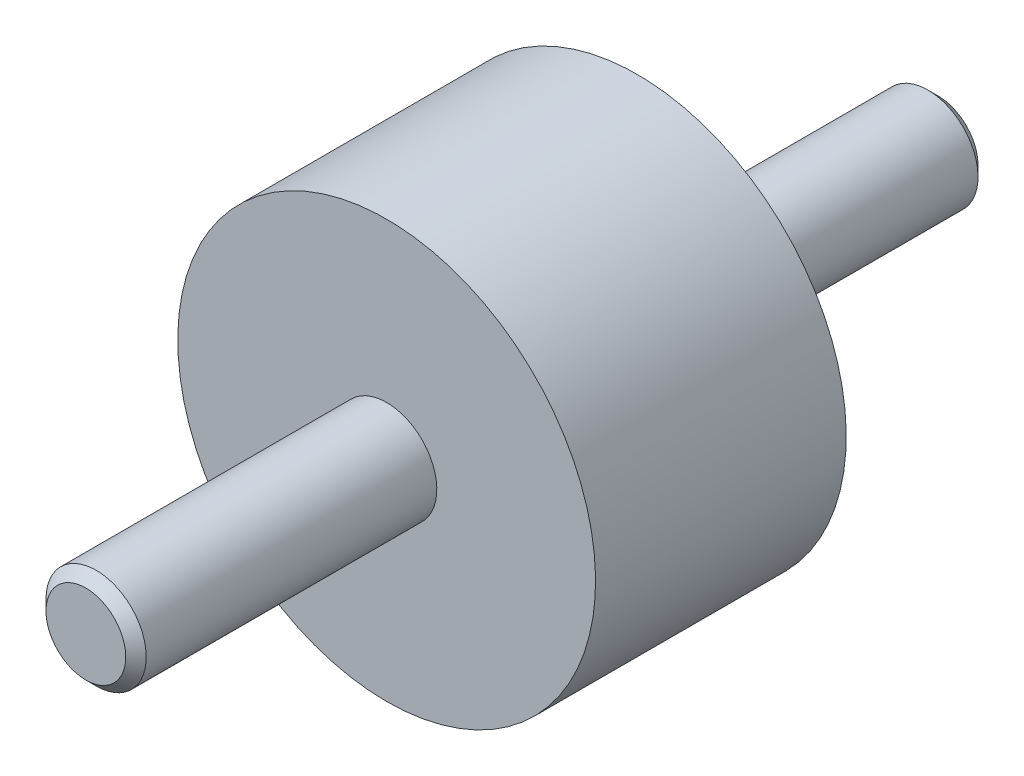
ISO-10303-21;
HEADER;
FILE_DESCRIPTION(('STEP AP214'),'2;1');
FILE_NAME('part.step','',(''),(''),'','','');
FILE_SCHEMA(('AUTOMOTIVE_DESIGN { 1 0 10303 214 1 1 1 1 }'));
ENDSEC;
DATA;
#1=APPLICATION_CONTEXT('core data for automotive mechanical design processes');
#2=APPLICATION_PROTOCOL_DEFINITION('international standard','automotive_design',2000,#1);
#3=PRODUCT_CONTEXT('',#1,'mechanical');
#4=PRODUCT('Part','Part','',(#3));
#5=PRODUCT_RELATED_PRODUCT_CATEGORY('part','',(#4));
#6=PRODUCT_DEFINITION_FORMATION('','',#4);
#7=PRODUCT_DEFINITION_CONTEXT('part definition',#1,'design');
#8=PRODUCT_DEFINITION('design','',#6,#7);
#9=PRODUCT_DEFINITION_SHAPE('','',#8);
#10=(LENGTH_UNIT() NAMED_UNIT(*) SI_UNIT(.MILLI.,.METRE.));
#11=(NAMED_UNIT(*) PLANE_ANGLE_UNIT() SI_UNIT($,.RADIAN.));
#12=(NAMED_UNIT(*) SI_UNIT($,.STERADIAN.) SOLID_ANGLE_UNIT());
#13=UNCERTAINTY_MEASURE_WITH_UNIT(LENGTH_MEASURE(1.E-05),#10,'distance_accuracy_value','');
#14=(GEOMETRIC_REPRESENTATION_CONTEXT(3) GLOBAL_UNCERTAINTY_ASSIGNED_CONTEXT((#13)) GLOBAL_UNIT_ASSIGNED_CONTEXT((#10,
#11,#12)) REPRESENTATION_CONTEXT('',''));
#15=CARTESIAN_POINT('',(0.,0.,0.));
#16=DIRECTION('',(0.,0.,1.));
#17=DIRECTION('',(1.,0.,0.));
#18=AXIS2_PLACEMENT_3D('',#15,#16,#17);
#19=CARTESIAN_POINT('',(11.666666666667,0.,15.));
#20=DIRECTION('',(0.,0.,1.));
#21=DIRECTION('',(0.,-1.,0.));
#22=AXIS2_PLACEMENT_3D('',#19,#20,#21);
#23=PLANE('',#22);
#24=CARTESIAN_POINT('',(0.,0.,15.));
#25=DIRECTION('',(0.,0.,1.));
#26=DIRECTION('',(0.,-1.,0.));
#27=AXIS2_PLACEMENT_3D('',#24,#25,#26);
#28=CIRCLE('',#27,3.);
#29=CARTESIAN_POINT('',(0.,-3.,15.));
#30=VERTEX_POINT('',#29);
#31=EDGE_CURVE('E8',#30,#30,#28,.T.);
#32=ORIENTED_EDGE('',*,*,#31,.F.);
#33=EDGE_LOOP('',(#32));
#34=FACE_BOUND('',#33,.T.);
#35=CARTESIAN_POINT('',(0.,0.,15.));
#36=DIRECTION('',(0.,0.,1.));
#37=DIRECTION('',(0.,-1.,0.));
#38=AXIS2_PLACEMENT_3D('',#35,#36,#37);
#39=CIRCLE('',#38,12.5);
#40=CARTESIAN_POINT('',(0.,-12.5,15.));
#41=VERTEX_POINT('',#40);
#42=EDGE_CURVE('E22',#41,#41,#39,.T.);
#43=ORIENTED_EDGE('',*,*,#42,.T.);
#44=EDGE_LOOP('',(#43));
#45=FACE_BOUND('',#44,.T.);
#46=ADVANCED_FACE('F12',(#34,#45),#23,.T.);
#47=CARTESIAN_POINT('',(0.,0.,0.5));
#48=DIRECTION('',(0.,0.,1.));
#49=DIRECTION('',(0.,-1.,0.));
#50=AXIS2_PLACEMENT_3D('',#47,#48,#49);
#51=CYLINDRICAL_SURFACE('',#50,12.5);
#52=CARTESIAN_POINT('',(0.,0.,0.));
#53=DIRECTION('',(0.,0.,1.));
#54=DIRECTION('',(0.,-1.,0.));
#55=AXIS2_PLACEMENT_3D('',#52,#53,#54);
#56=CIRCLE('',#55,12.5);
#57=CARTESIAN_POINT('',(0.,-12.5,0.));
#58=VERTEX_POINT('',#57);
#59=EDGE_CURVE('E26',#58,#58,#56,.T.);
#60=ORIENTED_EDGE('',*,*,#59,.T.);
#61=EDGE_LOOP('',(#60));
#62=FACE_BOUND('',#61,.T.);
#63=ORIENTED_EDGE('',*,*,#42,.F.);
#64=EDGE_LOOP('',(#63));
#65=FACE_BOUND('',#64,.T.);
#66=ADVANCED_FACE('F57',(#62,#65),#51,.T.);
#67=CARTESIAN_POINT('',(12.5,0.,0.));
#68=DIRECTION('',(0.,0.,-1.));
#69=DIRECTION('',(0.,1.,0.));
#70=AXIS2_PLACEMENT_3D('',#67,#68,#69);
#71=PLANE('',#70);
#72=CARTESIAN_POINT('',(0.,0.,0.));
#73=DIRECTION('',(0.,0.,-1.));
#74=DIRECTION('',(0.,1.,0.));
#75=AXIS2_PLACEMENT_3D('',#72,#73,#74);
#76=CIRCLE('',#75,3.);
#77=CARTESIAN_POINT('',(0.,3.,0.));
#78=VERTEX_POINT('',#77);
#79=EDGE_CURVE('E18',#78,#78,#76,.T.);
#80=ORIENTED_EDGE('',*,*,#79,.F.);
#81=EDGE_LOOP('',(#80));
#82=FACE_BOUND('',#81,.T.);
#83=ORIENTED_EDGE('',*,*,#59,.F.);
#84=EDGE_LOOP('',(#83));
#85=FACE_BOUND('',#84,.T.);
#86=ADVANCED_FACE('F62',(#82,#85),#71,.T.);
#87=CARTESIAN_POINT('',(0.,0.,-18.));
#88=DIRECTION('',(0.,0.,1.));
#89=DIRECTION('',(0.,-1.,0.));
#90=AXIS2_PLACEMENT_3D('',#87,#88,#89);
#91=CYLINDRICAL_SURFACE('',#90,3.);
#92=CARTESIAN_POINT('',(0.,0.,-17.3865));
#93=DIRECTION('',(0.,0.,1.));
#94=DIRECTION('',(0.,-1.,0.));
#95=AXIS2_PLACEMENT_3D('',#92,#93,#94);
#96=CIRCLE('',#95,3.);
#97=CARTESIAN_POINT('',(0.,-3.,-17.3865));
#98=VERTEX_POINT('',#97);
#99=EDGE_CURVE('E31',#98,#98,#96,.T.);
#100=ORIENTED_EDGE('',*,*,#99,.T.);
#101=EDGE_LOOP('',(#100));
#102=FACE_BOUND('',#101,.T.);
#103=ORIENTED_EDGE('',*,*,#79,.T.);
#104=EDGE_LOOP('',(#103));
#105=FACE_BOUND('',#104,.T.);
#106=ADVANCED_FACE('F70',(#102,#105),#91,.T.);
#107=CARTESIAN_POINT('',(0.,0.,-17.3865));
#108=DIRECTION('',(0.,0.,1.));
#109=DIRECTION('',(0.,-1.,0.));
#110=AXIS2_PLACEMENT_3D('',#107,#108,#109);
#111=CONICAL_SURFACE('',#110,3.,0.785398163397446);
#112=CARTESIAN_POINT('',(0.,0.,-18.));
#113=DIRECTION('',(0.,0.,1.));
#114=DIRECTION('',(0.,-1.,0.));
#115=AXIS2_PLACEMENT_3D('',#112,#113,#114);
#116=CIRCLE('',#115,2.3865);
#117=CARTESIAN_POINT('',(0.,-2.3865,-18.));
#118=VERTEX_POINT('',#117);
#119=EDGE_CURVE('E34',#118,#118,#116,.T.);
#120=ORIENTED_EDGE('',*,*,#119,.T.);
#121=EDGE_LOOP('',(#120));
#122=FACE_BOUND('',#121,.T.);
#123=ORIENTED_EDGE('',*,*,#99,.F.);
#124=EDGE_LOOP('',(#123));
#125=FACE_BOUND('',#124,.T.);
#126=ADVANCED_FACE('F76',(#122,#125),#111,.T.);
#127=CARTESIAN_POINT('',(2.3865,0.,-18.));
#128=DIRECTION('',(0.,0.,-1.));
#129=DIRECTION('',(0.,1.,0.));
#130=AXIS2_PLACEMENT_3D('',#127,#128,#129);
#131=PLANE('',#130);
#132=ORIENTED_EDGE('',*,*,#119,.F.);
#133=EDGE_LOOP('',(#132));
#134=FACE_BOUND('',#133,.T.);
#135=ADVANCED_FACE('F80',(#134),#131,.T.);
#136=CARTESIAN_POINT('',(0.,0.,33.));
#137=DIRECTION('',(0.,0.,1.));
#138=DIRECTION('',(0.,-1.,0.));
#139=AXIS2_PLACEMENT_3D('',#136,#137,#138);
#140=PLANE('',#139);
#141=CARTESIAN_POINT('',(0.,0.,33.));
#142=DIRECTION('',(0.,0.,1.));
#143=DIRECTION('',(0.,-1.,0.));
#144=AXIS2_PLACEMENT_3D('',#141,#142,#143);
#145=CIRCLE('',#144,2.3865);
#146=CARTESIAN_POINT('',(0.,-2.3865,33.));
#147=VERTEX_POINT('',#146);
#148=EDGE_CURVE('E37',#147,#147,#145,.T.);
#149=ORIENTED_EDGE('',*,*,#148,.T.);
#150=EDGE_LOOP('',(#149));
#151=FACE_BOUND('',#150,.T.);
#152=ADVANCED_FACE('F54',(#151),#140,.T.);
#153=CARTESIAN_POINT('',(0.,0.,33.));
#154=DIRECTION('',(0.,0.,-1.));
#155=DIRECTION('',(0.,1.,0.));
#156=AXIS2_PLACEMENT_3D('',#153,#154,#155);
#157=CONICAL_SURFACE('',#156,2.3865,0.785398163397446);
#158=CARTESIAN_POINT('',(0.,0.,32.3865));
#159=DIRECTION('',(0.,0.,1.));
#160=DIRECTION('',(0.,-1.,0.));
#161=AXIS2_PLACEMENT_3D('',#158,#159,#160);
#162=CIRCLE('',#161,3.);
#163=CARTESIAN_POINT('',(0.,-3.,32.3865));
#164=VERTEX_POINT('',#163);
#165=EDGE_CURVE('E40',#164,#164,#162,.T.);
#166=ORIENTED_EDGE('',*,*,#165,.T.);
#167=EDGE_LOOP('',(#166));
#168=FACE_BOUND('',#167,.T.);
#169=ORIENTED_EDGE('',*,*,#148,.F.);
#170=EDGE_LOOP('',(#169));
#171=FACE_BOUND('',#170,.T.);
#172=ADVANCED_FACE('F44',(#168,#171),#157,.T.);
#173=CARTESIAN_POINT('',(0.,0.,15.));
#174=DIRECTION('',(0.,0.,1.));
#175=DIRECTION('',(0.,-1.,0.));
#176=AXIS2_PLACEMENT_3D('',#173,#174,#175);
#177=CYLINDRICAL_SURFACE('',#176,3.);
#178=ORIENTED_EDGE('',*,*,#31,.T.);
#179=EDGE_LOOP('',(#178));
#180=FACE_BOUND('',#179,.T.);
#181=ORIENTED_EDGE('',*,*,#165,.F.);
#182=EDGE_LOOP('',(#181));
#183=FACE_BOUND('',#182,.T.);
#184=ADVANCED_FACE('F47',(#180,#183),#177,.T.);
#185=CLOSED_SHELL('',(#46,#66,#86,#106,#126,#135,#152,#172,#184));
#186=MANIFOLD_SOLID_BREP('B1',#185);
#187=ADVANCED_BREP_SHAPE_REPRESENTATION('',(#18,#186),#14);
#188=SHAPE_DEFINITION_REPRESENTATION(#9,#187);
ENDSEC;
END-ISO-10303-21;
